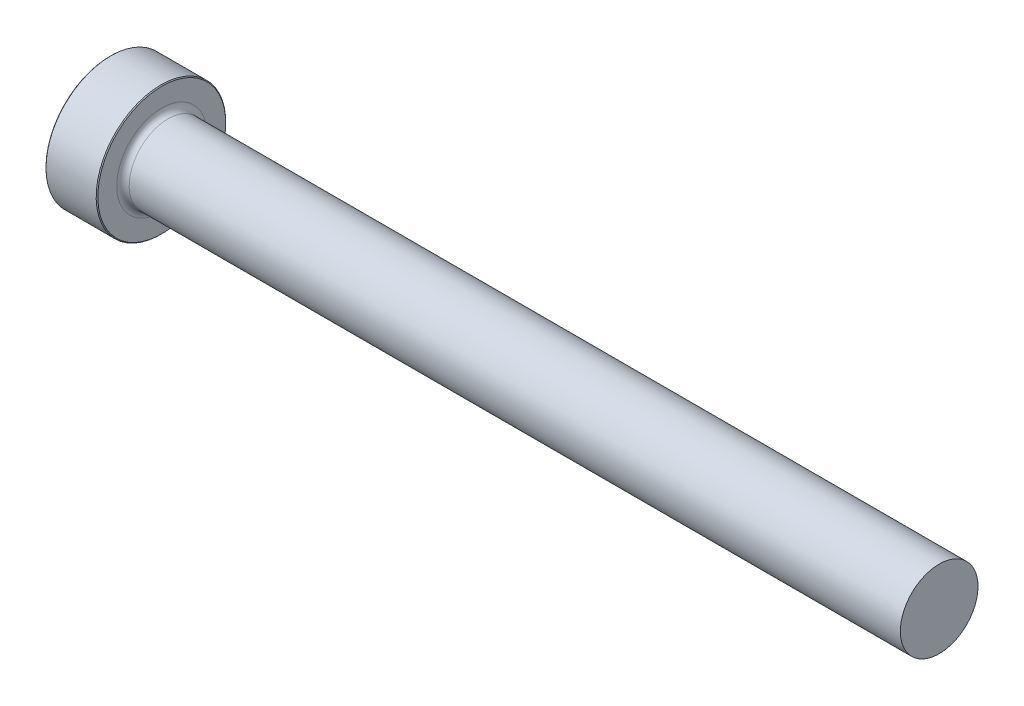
ISO-10303-21;
HEADER;
FILE_DESCRIPTION(('STEP AP214'),'2;1');
FILE_NAME('part.step','',(''),(''),'','','');
FILE_SCHEMA(('AUTOMOTIVE_DESIGN { 1 0 10303 214 1 1 1 1 }'));
ENDSEC;
DATA;
#1=APPLICATION_CONTEXT('core data for automotive mechanical design processes');
#2=APPLICATION_PROTOCOL_DEFINITION('international standard','automotive_design',2000,#1);
#3=PRODUCT_CONTEXT('',#1,'mechanical');
#4=PRODUCT('Part','Part','',(#3));
#5=PRODUCT_RELATED_PRODUCT_CATEGORY('part','',(#4));
#6=PRODUCT_DEFINITION_FORMATION('','',#4);
#7=PRODUCT_DEFINITION_CONTEXT('part definition',#1,'design');
#8=PRODUCT_DEFINITION('design','',#6,#7);
#9=PRODUCT_DEFINITION_SHAPE('','',#8);
#10=(LENGTH_UNIT() NAMED_UNIT(*) SI_UNIT(.MILLI.,.METRE.));
#11=(NAMED_UNIT(*) PLANE_ANGLE_UNIT() SI_UNIT($,.RADIAN.));
#12=(NAMED_UNIT(*) SI_UNIT($,.STERADIAN.) SOLID_ANGLE_UNIT());
#13=UNCERTAINTY_MEASURE_WITH_UNIT(LENGTH_MEASURE(1.E-05),#10,'distance_accuracy_value','');
#14=(GEOMETRIC_REPRESENTATION_CONTEXT(3) GLOBAL_UNCERTAINTY_ASSIGNED_CONTEXT((#13)) GLOBAL_UNIT_ASSIGNED_CONTEXT((#10,
#11,#12)) REPRESENTATION_CONTEXT('',''));
#15=CARTESIAN_POINT('',(0.,0.,0.));
#16=DIRECTION('',(0.,0.,1.));
#17=DIRECTION('',(1.,0.,0.));
#18=AXIS2_PLACEMENT_3D('',#15,#16,#17);
#19=CARTESIAN_POINT('',(101.6,4.75868999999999,0.));
#20=DIRECTION('',(1.,0.,0.));
#21=DIRECTION('',(0.,1.,0.));
#22=AXIS2_PLACEMENT_3D('',#19,#20,#21);
#23=PLANE('',#22);
#24=CARTESIAN_POINT('',(101.6,0.,0.));
#25=DIRECTION('',(1.,0.,0.));
#26=DIRECTION('',(0.,1.,0.));
#27=AXIS2_PLACEMENT_3D('',#24,#25,#26);
#28=CIRCLE('',#27,4.75869);
#29=CARTESIAN_POINT('',(101.6,4.75868999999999,0.));
#30=VERTEX_POINT('',#29);
#31=EDGE_CURVE('E50',#30,#30,#28,.T.);
#32=ORIENTED_EDGE('',*,*,#31,.T.);
#33=EDGE_LOOP('',(#32));
#34=FACE_BOUND('',#33,.T.);
#35=ADVANCED_FACE('F30',(#34),#23,.T.);
#36=CARTESIAN_POINT('',(101.6,0.,0.));
#37=DIRECTION('',(1.,0.,0.));
#38=DIRECTION('',(0.,1.,0.));
#39=AXIS2_PLACEMENT_3D('',#36,#37,#38);
#40=CYLINDRICAL_SURFACE('',#39,4.75869);
#41=CARTESIAN_POINT('',(7.11199999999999,0.,0.));
#42=DIRECTION('',(1.,0.,0.));
#43=DIRECTION('',(0.,1.,0.));
#44=AXIS2_PLACEMENT_3D('',#41,#42,#43);
#45=CIRCLE('',#44,4.75868999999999);
#46=CARTESIAN_POINT('',(7.11199999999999,4.75868999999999,0.));
#47=VERTEX_POINT('',#46);
#48=EDGE_CURVE('E53',#47,#47,#45,.T.);
#49=ORIENTED_EDGE('',*,*,#48,.T.);
#50=EDGE_LOOP('',(#49));
#51=FACE_BOUND('',#50,.T.);
#52=ORIENTED_EDGE('',*,*,#31,.F.);
#53=EDGE_LOOP('',(#52));
#54=FACE_BOUND('',#53,.T.);
#55=ADVANCED_FACE('F74',(#51,#54),#40,.T.);
#56=CARTESIAN_POINT('',(7.112,0.,0.));
#57=DIRECTION('',(1.,0.,0.));
#58=DIRECTION('',(0.,1.,0.));
#59=AXIS2_PLACEMENT_3D('',#56,#57,#58);
#60=TOROIDAL_SURFACE('',#59,5.52068999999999,0.762);
#61=CARTESIAN_POINT('',(6.34999999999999,0.,0.));
#62=DIRECTION('',(1.,0.,0.));
#63=DIRECTION('',(0.,1.,0.));
#64=AXIS2_PLACEMENT_3D('',#61,#62,#63);
#65=CIRCLE('',#64,5.52068999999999);
#66=CARTESIAN_POINT('',(6.34999999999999,5.52068999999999,0.));
#67=VERTEX_POINT('',#66);
#68=EDGE_CURVE('E56',#67,#67,#65,.T.);
#69=ORIENTED_EDGE('',*,*,#68,.T.);
#70=EDGE_LOOP('',(#69));
#71=FACE_BOUND('',#70,.T.);
#72=ORIENTED_EDGE('',*,*,#48,.F.);
#73=EDGE_LOOP('',(#72));
#74=FACE_BOUND('',#73,.T.);
#75=ADVANCED_FACE('F60',(#71,#74),#60,.F.);
#76=CARTESIAN_POINT('',(6.35,7.9375,0.));
#77=DIRECTION('',(1.,0.,0.));
#78=DIRECTION('',(0.,1.,0.));
#79=AXIS2_PLACEMENT_3D('',#76,#77,#78);
#80=PLANE('',#79);
#81=CARTESIAN_POINT('',(6.35,0.,0.));
#82=DIRECTION('',(1.,0.,0.));
#83=DIRECTION('',(0.,1.,0.));
#84=AXIS2_PLACEMENT_3D('',#81,#82,#83);
#85=CIRCLE('',#84,7.8359);
#86=CARTESIAN_POINT('',(6.35,7.8359,0.));
#87=VERTEX_POINT('',#86);
#88=EDGE_CURVE('E10',#87,#87,#85,.T.);
#89=ORIENTED_EDGE('',*,*,#88,.T.);
#90=EDGE_LOOP('',(#89));
#91=FACE_BOUND('',#90,.T.);
#92=ORIENTED_EDGE('',*,*,#68,.F.);
#93=EDGE_LOOP('',(#92));
#94=FACE_BOUND('',#93,.T.);
#95=ADVANCED_FACE('F63',(#91,#94),#80,.T.);
#96=CARTESIAN_POINT('',(101.6,0.,0.));
#97=DIRECTION('',(1.,0.,0.));
#98=DIRECTION('',(0.,1.,0.));
#99=AXIS2_PLACEMENT_3D('',#96,#97,#98);
#100=CYLINDRICAL_SURFACE('',#99,7.9375);
#101=CARTESIAN_POINT('',(0.101599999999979,0.,0.));
#102=DIRECTION('',(-1.,0.,0.));
#103=DIRECTION('',(0.,-1.,0.));
#104=AXIS2_PLACEMENT_3D('',#101,#102,#103);
#105=CIRCLE('',#104,7.9375);
#106=CARTESIAN_POINT('',(0.101599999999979,-7.9375,0.));
#107=VERTEX_POINT('',#106);
#108=EDGE_CURVE('E41',#107,#107,#105,.F.);
#109=ORIENTED_EDGE('',*,*,#108,.T.);
#110=EDGE_LOOP('',(#109));
#111=FACE_BOUND('',#110,.T.);
#112=CARTESIAN_POINT('',(6.2484,0.,0.));
#113=DIRECTION('',(1.,0.,0.));
#114=DIRECTION('',(0.,1.,0.));
#115=AXIS2_PLACEMENT_3D('',#112,#113,#114);
#116=CIRCLE('',#115,7.9375);
#117=CARTESIAN_POINT('',(6.2484,7.9375,0.));
#118=VERTEX_POINT('',#117);
#119=EDGE_CURVE('E45',#118,#118,#116,.F.);
#120=ORIENTED_EDGE('',*,*,#119,.T.);
#121=EDGE_LOOP('',(#120));
#122=FACE_BOUND('',#121,.T.);
#123=ADVANCED_FACE('F65',(#111,#122),#100,.T.);
#124=CARTESIAN_POINT('',(0.,0.,0.));
#125=DIRECTION('',(-1.,0.,0.));
#126=DIRECTION('',(0.,-1.,0.));
#127=AXIS2_PLACEMENT_3D('',#124,#125,#126);
#128=PLANE('',#127);
#129=CARTESIAN_POINT('',(0.,0.,0.));
#130=DIRECTION('',(-1.,0.,0.));
#131=DIRECTION('',(0.,-1.,0.));
#132=AXIS2_PLACEMENT_3D('',#129,#130,#131);
#133=CIRCLE('',#132,7.83590000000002);
#134=CARTESIAN_POINT('',(0.,-7.83590000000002,0.));
#135=VERTEX_POINT('',#134);
#136=EDGE_CURVE('E37',#135,#135,#133,.T.);
#137=ORIENTED_EDGE('',*,*,#136,.T.);
#138=EDGE_LOOP('',(#137));
#139=FACE_BOUND('',#138,.T.);
#140=ADVANCED_FACE('F71',(#139),#128,.T.);
#141=CARTESIAN_POINT('',(0.101599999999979,0.,0.));
#142=DIRECTION('',(1.,0.,0.));
#143=DIRECTION('',(0.,1.,0.));
#144=AXIS2_PLACEMENT_3D('',#141,#142,#143);
#145=CONICAL_SURFACE('',#144,7.9375,0.785398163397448);
#146=ORIENTED_EDGE('',*,*,#136,.F.);
#147=EDGE_LOOP('',(#146));
#148=FACE_BOUND('',#147,.T.);
#149=ORIENTED_EDGE('',*,*,#108,.F.);
#150=EDGE_LOOP('',(#149));
#151=FACE_BOUND('',#150,.T.);
#152=ADVANCED_FACE('F84',(#148,#151),#145,.T.);
#153=CARTESIAN_POINT('',(6.34999999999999,0.,0.));
#154=DIRECTION('',(-1.,0.,0.));
#155=DIRECTION('',(0.,-1.,0.));
#156=AXIS2_PLACEMENT_3D('',#153,#154,#155);
#157=CONICAL_SURFACE('',#156,7.83590000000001,0.785398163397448);
#158=ORIENTED_EDGE('',*,*,#119,.F.);
#159=EDGE_LOOP('',(#158));
#160=FACE_BOUND('',#159,.T.);
#161=ORIENTED_EDGE('',*,*,#88,.F.);
#162=EDGE_LOOP('',(#161));
#163=FACE_BOUND('',#162,.T.);
#164=ADVANCED_FACE('F32',(#160,#163),#157,.T.);
#165=CLOSED_SHELL('',(#35,#55,#75,#95,#123,#140,#152,#164));
#166=MANIFOLD_SOLID_BREP('B2',#165);
#167=ADVANCED_BREP_SHAPE_REPRESENTATION('',(#18,#166),#14);
#168=SHAPE_DEFINITION_REPRESENTATION(#9,#167);
ENDSEC;
END-ISO-10303-21;
